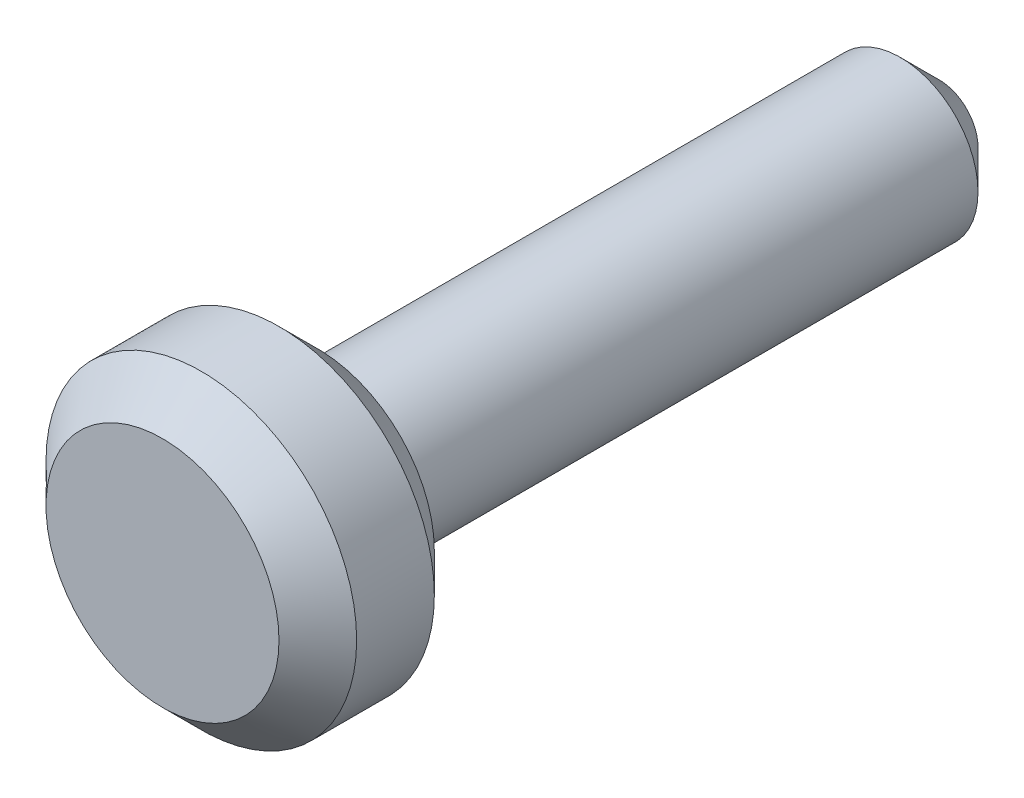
from build123d import *

# Parameters (mm, degrees)
ESQUISSE1_R      = 1
EXTRUSION1_DEPTH = 8
ESQUISSE2_R      = 2
EXTRUSION2_DEPTH = 2
CHANFREIN1_SIZE  = 0.5


with BuildPart() as part:
    # Esquisse1 → Extrusion1 (new body)
    with BuildSketch(Plane.XY):
        Circle(ESQUISSE1_R)
    extrude(amount=EXTRUSION1_DEPTH)

    # Esquisse2 → Extrusion2 (add)
    with BuildSketch(Plane.XY.offset(8)):
        Circle(ESQUISSE2_R)
    extrude(amount=EXTRUSION2_DEPTH)

    # Chanfrein1
    chanfrein1_edges = [part.edges().sort_by_distance(p)[0] for p in [
        (-2, 0, 8),
        (-2, 0, 10),
        (-1, 0, 0),
    ]]
    chamfer(chanfrein1_edges, length=CHANFREIN1_SIZE)


solid = part.part
